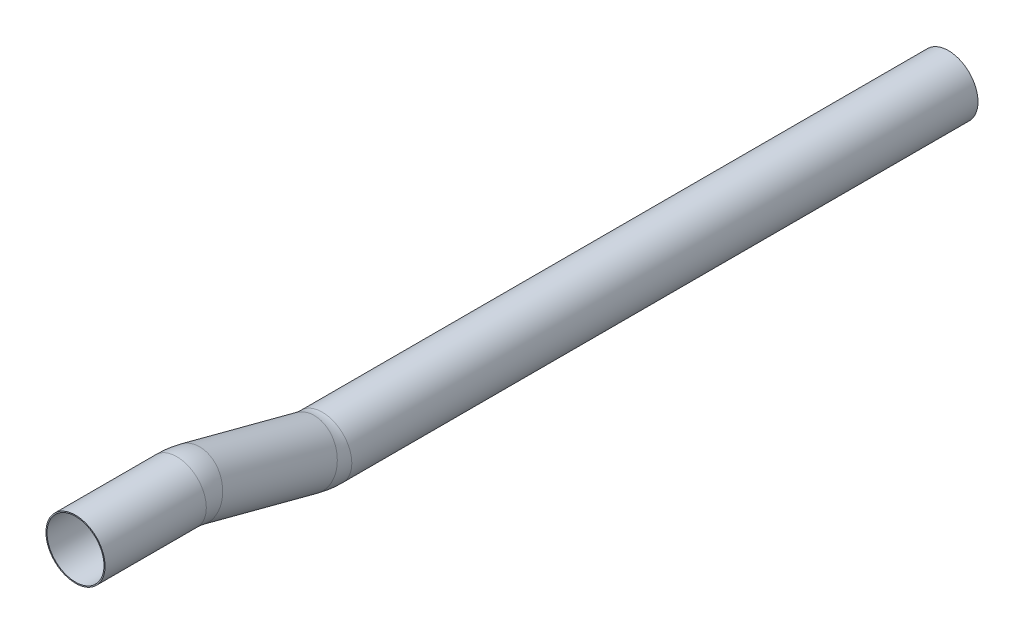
ISO-10303-21;
HEADER;
FILE_DESCRIPTION(('STEP AP214'),'2;1');
FILE_NAME('part.step','',(''),(''),'','','');
FILE_SCHEMA(('AUTOMOTIVE_DESIGN { 1 0 10303 214 1 1 1 1 }'));
ENDSEC;
DATA;
#1=APPLICATION_CONTEXT('core data for automotive mechanical design processes');
#2=APPLICATION_PROTOCOL_DEFINITION('international standard','automotive_design',2000,#1);
#3=PRODUCT_CONTEXT('',#1,'mechanical');
#4=PRODUCT('Part','Part','',(#3));
#5=PRODUCT_RELATED_PRODUCT_CATEGORY('part','',(#4));
#6=PRODUCT_DEFINITION_FORMATION('','',#4);
#7=PRODUCT_DEFINITION_CONTEXT('part definition',#1,'design');
#8=PRODUCT_DEFINITION('design','',#6,#7);
#9=PRODUCT_DEFINITION_SHAPE('','',#8);
#10=(LENGTH_UNIT() NAMED_UNIT(*) SI_UNIT(.MILLI.,.METRE.));
#11=(NAMED_UNIT(*) PLANE_ANGLE_UNIT() SI_UNIT($,.RADIAN.));
#12=(NAMED_UNIT(*) SI_UNIT($,.STERADIAN.) SOLID_ANGLE_UNIT());
#13=UNCERTAINTY_MEASURE_WITH_UNIT(LENGTH_MEASURE(1.E-05),#10,'distance_accuracy_value','');
#14=(GEOMETRIC_REPRESENTATION_CONTEXT(3) GLOBAL_UNCERTAINTY_ASSIGNED_CONTEXT((#13)) GLOBAL_UNIT_ASSIGNED_CONTEXT((#10,
#11,#12)) REPRESENTATION_CONTEXT('',''));
#15=CARTESIAN_POINT('',(0.,0.,0.));
#16=DIRECTION('',(0.,0.,1.));
#17=DIRECTION('',(1.,0.,0.));
#18=AXIS2_PLACEMENT_3D('',#15,#16,#17);
#19=CARTESIAN_POINT('',(0.,-143.256,-1033.90553325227));
#20=DIRECTION('',(0.,0.,-1.));
#21=DIRECTION('',(0.,1.,0.));
#22=AXIS2_PLACEMENT_3D('',#19,#20,#21);
#23=CYLINDRICAL_SURFACE('',#22,123.825);
#24=CARTESIAN_POINT('',(0.,-143.256,-1033.90553325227));
#25=DIRECTION('',(0.,0.,1.));
#26=DIRECTION('',(1.,0.,0.));
#27=AXIS2_PLACEMENT_3D('',#24,#25,#26);
#28=CIRCLE('',#27,123.825);
#29=CARTESIAN_POINT('',(0.,-267.081,-1033.90553325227));
#30=VERTEX_POINT('',#29);
#31=EDGE_CURVE('E39',#30,#30,#28,.T.);
#32=ORIENTED_EDGE('',*,*,#31,.F.);
#33=EDGE_LOOP('',(#32));
#34=FACE_BOUND('',#33,.T.);
#35=CARTESIAN_POINT('',(0.,-143.256,-3657.6));
#36=DIRECTION('',(0.,0.,1.));
#37=DIRECTION('',(1.,0.,0.));
#38=AXIS2_PLACEMENT_3D('',#35,#36,#37);
#39=CIRCLE('',#38,123.825);
#40=CARTESIAN_POINT('',(123.825,-143.256,-3657.6));
#41=VERTEX_POINT('',#40);
#42=EDGE_CURVE('E10',#41,#41,#39,.T.);
#43=ORIENTED_EDGE('',*,*,#42,.T.);
#44=EDGE_LOOP('',(#43));
#45=FACE_BOUND('',#44,.T.);
#46=ADVANCED_FACE('F29',(#34,#45),#23,.T.);
#47=CARTESIAN_POINT('',(0.,-143.256,-1033.90553325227));
#48=DIRECTION('',(0.,0.,-1.));
#49=DIRECTION('',(0.,1.,0.));
#50=AXIS2_PLACEMENT_3D('',#47,#48,#49);
#51=CYLINDRICAL_SURFACE('',#50,119.38);
#52=CARTESIAN_POINT('',(0.,-143.256,-1033.90553325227));
#53=DIRECTION('',(0.,0.,1.));
#54=DIRECTION('',(1.,0.,0.));
#55=AXIS2_PLACEMENT_3D('',#52,#53,#54);
#56=CIRCLE('',#55,119.38);
#57=CARTESIAN_POINT('',(0.,-262.636,-1033.90553325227));
#58=VERTEX_POINT('',#57);
#59=EDGE_CURVE('E43',#58,#58,#56,.T.);
#60=ORIENTED_EDGE('',*,*,#59,.T.);
#61=EDGE_LOOP('',(#60));
#62=FACE_BOUND('',#61,.T.);
#63=CARTESIAN_POINT('',(0.,-143.256,-3657.6));
#64=DIRECTION('',(0.,0.,1.));
#65=DIRECTION('',(1.,0.,0.));
#66=AXIS2_PLACEMENT_3D('',#63,#64,#65);
#67=CIRCLE('',#66,119.38);
#68=CARTESIAN_POINT('',(119.38,-143.256,-3657.6));
#69=VERTEX_POINT('',#68);
#70=EDGE_CURVE('E35',#69,#69,#67,.T.);
#71=ORIENTED_EDGE('',*,*,#70,.F.);
#72=EDGE_LOOP('',(#71));
#73=FACE_BOUND('',#72,.T.);
#74=ADVANCED_FACE('F98',(#62,#73),#51,.F.);
#75=CARTESIAN_POINT('',(0.,110.744,-1033.90553325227));
#76=DIRECTION('',(1.,0.,0.));
#77=DIRECTION('',(0.,0.,-1.));
#78=AXIS2_PLACEMENT_3D('',#75,#76,#77);
#79=TOROIDAL_SURFACE('',#78,254.,123.825);
#80=CARTESIAN_POINT('',(0.,-134.876492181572,-969.201794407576));
#81=DIRECTION('',(0.,0.254739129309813,0.967009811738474));
#82=DIRECTION('',(1.,0.,0.));
#83=AXIS2_PLACEMENT_3D('',#80,#81,#82);
#84=CIRCLE('',#83,123.825);
#85=CARTESIAN_POINT('',(0.,-254.616482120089,-937.658721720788));
#86=VERTEX_POINT('',#85);
#87=EDGE_CURVE('E48',#86,#86,#84,.T.);
#88=CARTESIAN_POINT('',(0.,110.744,-1033.90553325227));
#89=DIRECTION('',(1.,0.,0.));
#90=DIRECTION('',(0.,0.,-1.));
#91=AXIS2_PLACEMENT_3D('',#88,#89,#90);
#92=CIRCLE('',#91,377.825);
#93=EDGE_CURVE('',#86,#30,#92,.T.);
#94=ORIENTED_EDGE('',*,*,#87,.F.);
#95=ORIENTED_EDGE('',*,*,#31,.T.);
#96=ORIENTED_EDGE('',*,*,#93,.T.);
#97=ORIENTED_EDGE('',*,*,#93,.F.);
#98=EDGE_LOOP('',(#94,#96,#95,#97));
#99=FACE_BOUND('',#98,.T.);
#100=ADVANCED_FACE('F103',(#99),#79,.T.);
#101=CARTESIAN_POINT('',(0.,110.744,-1033.90553325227));
#102=DIRECTION('',(1.,0.,0.));
#103=DIRECTION('',(0.,0.,-1.));
#104=AXIS2_PLACEMENT_3D('',#101,#102,#103);
#105=TOROIDAL_SURFACE('',#104,254.,119.38);
#106=CARTESIAN_POINT('',(0.,-134.876492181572,-969.201794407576));
#107=DIRECTION('',(0.,0.254739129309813,0.967009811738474));
#108=DIRECTION('',(1.,0.,0.));
#109=AXIS2_PLACEMENT_3D('',#106,#107,#108);
#110=CIRCLE('',#109,119.38);
#111=CARTESIAN_POINT('',(0.,-250.318123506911,-938.791037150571));
#112=VERTEX_POINT('',#111);
#113=EDGE_CURVE('E51',#112,#112,#110,.T.);
#114=CARTESIAN_POINT('',(0.,110.744,-1033.90553325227));
#115=DIRECTION('',(1.,0.,0.));
#116=DIRECTION('',(0.,0.,-1.));
#117=AXIS2_PLACEMENT_3D('',#114,#115,#116);
#118=CIRCLE('',#117,373.38);
#119=EDGE_CURVE('',#112,#58,#118,.T.);
#120=ORIENTED_EDGE('',*,*,#113,.T.);
#121=ORIENTED_EDGE('',*,*,#59,.F.);
#122=ORIENTED_EDGE('',*,*,#119,.T.);
#123=ORIENTED_EDGE('',*,*,#119,.F.);
#124=EDGE_LOOP('',(#120,#122,#121,#123));
#125=FACE_BOUND('',#124,.T.);
#126=ADVANCED_FACE('F108',(#125),#105,.F.);
#127=CARTESIAN_POINT('',(0.,-8.37950781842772,-489.009272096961));
#128=DIRECTION('',(0.,-0.254739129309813,-0.967009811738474));
#129=DIRECTION('',(0.,0.967009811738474,-0.254739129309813));
#130=AXIS2_PLACEMENT_3D('',#127,#128,#129);
#131=CYLINDRICAL_SURFACE('',#130,123.825);
#132=CARTESIAN_POINT('',(0.,-8.37950781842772,-489.009272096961));
#133=DIRECTION('',(0.,0.254739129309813,0.967009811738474));
#134=DIRECTION('',(1.,0.,0.));
#135=AXIS2_PLACEMENT_3D('',#132,#133,#134);
#136=CIRCLE('',#135,123.825);
#137=CARTESIAN_POINT('',(0.,111.360482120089,-520.552344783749));
#138=VERTEX_POINT('',#137);
#139=EDGE_CURVE('E54',#138,#138,#136,.T.);
#140=ORIENTED_EDGE('',*,*,#139,.F.);
#141=EDGE_LOOP('',(#140));
#142=FACE_BOUND('',#141,.T.);
#143=ORIENTED_EDGE('',*,*,#87,.T.);
#144=EDGE_LOOP('',(#143));
#145=FACE_BOUND('',#144,.T.);
#146=ADVANCED_FACE('F114',(#142,#145),#131,.T.);
#147=CARTESIAN_POINT('',(0.,-8.37950781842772,-489.009272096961));
#148=DIRECTION('',(0.,-0.254739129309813,-0.967009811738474));
#149=DIRECTION('',(0.,0.967009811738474,-0.254739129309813));
#150=AXIS2_PLACEMENT_3D('',#147,#148,#149);
#151=CYLINDRICAL_SURFACE('',#150,119.38);
#152=CARTESIAN_POINT('',(0.,-8.37950781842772,-489.009272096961));
#153=DIRECTION('',(0.,0.254739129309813,0.967009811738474));
#154=DIRECTION('',(1.,0.,0.));
#155=AXIS2_PLACEMENT_3D('',#152,#153,#154);
#156=CIRCLE('',#155,119.38);
#157=CARTESIAN_POINT('',(0.,107.062123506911,-519.420029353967));
#158=VERTEX_POINT('',#157);
#159=EDGE_CURVE('E57',#158,#158,#156,.T.);
#160=ORIENTED_EDGE('',*,*,#159,.T.);
#161=EDGE_LOOP('',(#160));
#162=FACE_BOUND('',#161,.T.);
#163=ORIENTED_EDGE('',*,*,#113,.F.);
#164=EDGE_LOOP('',(#163));
#165=FACE_BOUND('',#164,.T.);
#166=ADVANCED_FACE('F121',(#162,#165),#151,.F.);
#167=CARTESIAN_POINT('',(0.,-254.,-424.305533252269));
#168=DIRECTION('',(-1.,0.,0.));
#169=DIRECTION('',(0.,0.,1.));
#170=AXIS2_PLACEMENT_3D('',#167,#168,#169);
#171=TOROIDAL_SURFACE('',#170,254.,123.825);
#172=CARTESIAN_POINT('',(0.,0.,-424.305533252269));
#173=DIRECTION('',(0.,0.,1.));
#174=DIRECTION('',(1.,0.,0.));
#175=AXIS2_PLACEMENT_3D('',#172,#173,#174);
#176=CIRCLE('',#175,123.825);
#177=CARTESIAN_POINT('',(0.,123.825,-424.305533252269));
#178=VERTEX_POINT('',#177);
#179=EDGE_CURVE('E60',#178,#178,#176,.T.);
#180=CARTESIAN_POINT('',(0.,-254.,-424.305533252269));
#181=DIRECTION('',(-1.,0.,0.));
#182=DIRECTION('',(0.,0.,1.));
#183=AXIS2_PLACEMENT_3D('',#180,#181,#182);
#184=CIRCLE('',#183,377.825);
#185=EDGE_CURVE('',#178,#138,#184,.T.);
#186=ORIENTED_EDGE('',*,*,#179,.F.);
#187=ORIENTED_EDGE('',*,*,#139,.T.);
#188=ORIENTED_EDGE('',*,*,#185,.T.);
#189=ORIENTED_EDGE('',*,*,#185,.F.);
#190=EDGE_LOOP('',(#186,#188,#187,#189));
#191=FACE_BOUND('',#190,.T.);
#192=ADVANCED_FACE('F125',(#191),#171,.T.);
#193=CARTESIAN_POINT('',(0.,-254.,-424.305533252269));
#194=DIRECTION('',(-1.,0.,0.));
#195=DIRECTION('',(0.,0.,1.));
#196=AXIS2_PLACEMENT_3D('',#193,#194,#195);
#197=TOROIDAL_SURFACE('',#196,254.,119.38);
#198=CARTESIAN_POINT('',(0.,0.,-424.305533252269));
#199=DIRECTION('',(0.,0.,1.));
#200=DIRECTION('',(1.,0.,0.));
#201=AXIS2_PLACEMENT_3D('',#198,#199,#200);
#202=CIRCLE('',#201,119.38);
#203=CARTESIAN_POINT('',(0.,119.38,-424.305533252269));
#204=VERTEX_POINT('',#203);
#205=EDGE_CURVE('E64',#204,#204,#202,.T.);
#206=CARTESIAN_POINT('',(0.,-254.,-424.305533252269));
#207=DIRECTION('',(-1.,0.,0.));
#208=DIRECTION('',(0.,0.,1.));
#209=AXIS2_PLACEMENT_3D('',#206,#207,#208);
#210=CIRCLE('',#209,373.38);
#211=EDGE_CURVE('',#204,#158,#210,.T.);
#212=ORIENTED_EDGE('',*,*,#205,.T.);
#213=ORIENTED_EDGE('',*,*,#159,.F.);
#214=ORIENTED_EDGE('',*,*,#211,.T.);
#215=ORIENTED_EDGE('',*,*,#211,.F.);
#216=EDGE_LOOP('',(#212,#214,#213,#215));
#217=FACE_BOUND('',#216,.T.);
#218=ADVANCED_FACE('F73',(#217),#197,.F.);
#219=CARTESIAN_POINT('',(0.,0.,-424.305533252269));
#220=DIRECTION('',(0.,0.,1.));
#221=DIRECTION('',(1.,0.,0.));
#222=AXIS2_PLACEMENT_3D('',#219,#220,#221);
#223=CYLINDRICAL_SURFACE('',#222,119.38);
#224=ORIENTED_EDGE('',*,*,#205,.F.);
#225=EDGE_LOOP('',(#224));
#226=FACE_BOUND('',#225,.T.);
#227=CARTESIAN_POINT('',(0.,0.,0.));
#228=DIRECTION('',(0.,0.,1.));
#229=DIRECTION('',(1.,0.,0.));
#230=AXIS2_PLACEMENT_3D('',#227,#228,#229);
#231=CIRCLE('',#230,119.38);
#232=CARTESIAN_POINT('',(119.38,0.,0.));
#233=VERTEX_POINT('',#232);
#234=EDGE_CURVE('E65',#233,#233,#231,.T.);
#235=ORIENTED_EDGE('',*,*,#234,.T.);
#236=EDGE_LOOP('',(#235));
#237=FACE_BOUND('',#236,.T.);
#238=ADVANCED_FACE('F76',(#226,#237),#223,.F.);
#239=CARTESIAN_POINT('',(0.,0.,-424.305533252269));
#240=DIRECTION('',(0.,0.,1.));
#241=DIRECTION('',(1.,0.,0.));
#242=AXIS2_PLACEMENT_3D('',#239,#240,#241);
#243=CYLINDRICAL_SURFACE('',#242,123.825);
#244=ORIENTED_EDGE('',*,*,#179,.T.);
#245=EDGE_LOOP('',(#244));
#246=FACE_BOUND('',#245,.T.);
#247=CARTESIAN_POINT('',(0.,0.,0.));
#248=DIRECTION('',(0.,0.,1.));
#249=DIRECTION('',(1.,0.,0.));
#250=AXIS2_PLACEMENT_3D('',#247,#248,#249);
#251=CIRCLE('',#250,123.825);
#252=CARTESIAN_POINT('',(123.825,0.,0.));
#253=VERTEX_POINT('',#252);
#254=EDGE_CURVE('E61',#253,#253,#251,.T.);
#255=ORIENTED_EDGE('',*,*,#254,.F.);
#256=EDGE_LOOP('',(#255));
#257=FACE_BOUND('',#256,.T.);
#258=ADVANCED_FACE('F79',(#246,#257),#243,.T.);
#259=CARTESIAN_POINT('',(0.,-143.256,-3657.6));
#260=DIRECTION('',(0.,0.,1.));
#261=DIRECTION('',(1.,0.,0.));
#262=AXIS2_PLACEMENT_3D('',#259,#260,#261);
#263=PLANE('',#262);
#264=ORIENTED_EDGE('',*,*,#70,.T.);
#265=EDGE_LOOP('',(#264));
#266=FACE_BOUND('',#265,.T.);
#267=ORIENTED_EDGE('',*,*,#42,.F.);
#268=EDGE_LOOP('',(#267));
#269=FACE_BOUND('',#268,.T.);
#270=ADVANCED_FACE('F86',(#266,#269),#263,.F.);
#271=CARTESIAN_POINT('',(0.,0.,0.));
#272=DIRECTION('',(0.,0.,1.));
#273=DIRECTION('',(1.,0.,0.));
#274=AXIS2_PLACEMENT_3D('',#271,#272,#273);
#275=PLANE('',#274);
#276=ORIENTED_EDGE('',*,*,#234,.F.);
#277=EDGE_LOOP('',(#276));
#278=FACE_BOUND('',#277,.T.);
#279=ORIENTED_EDGE('',*,*,#254,.T.);
#280=EDGE_LOOP('',(#279));
#281=FACE_BOUND('',#280,.T.);
#282=ADVANCED_FACE('F83',(#278,#281),#275,.T.);
#283=CLOSED_SHELL('',(#46,#74,#100,#126,#146,#166,#192,#218,#238,#258,#270,#282));
#284=MANIFOLD_SOLID_BREP('B2',#283);
#285=ADVANCED_BREP_SHAPE_REPRESENTATION('',(#18,#284),#14);
#286=SHAPE_DEFINITION_REPRESENTATION(#9,#285);
ENDSEC;
END-ISO-10303-21;
